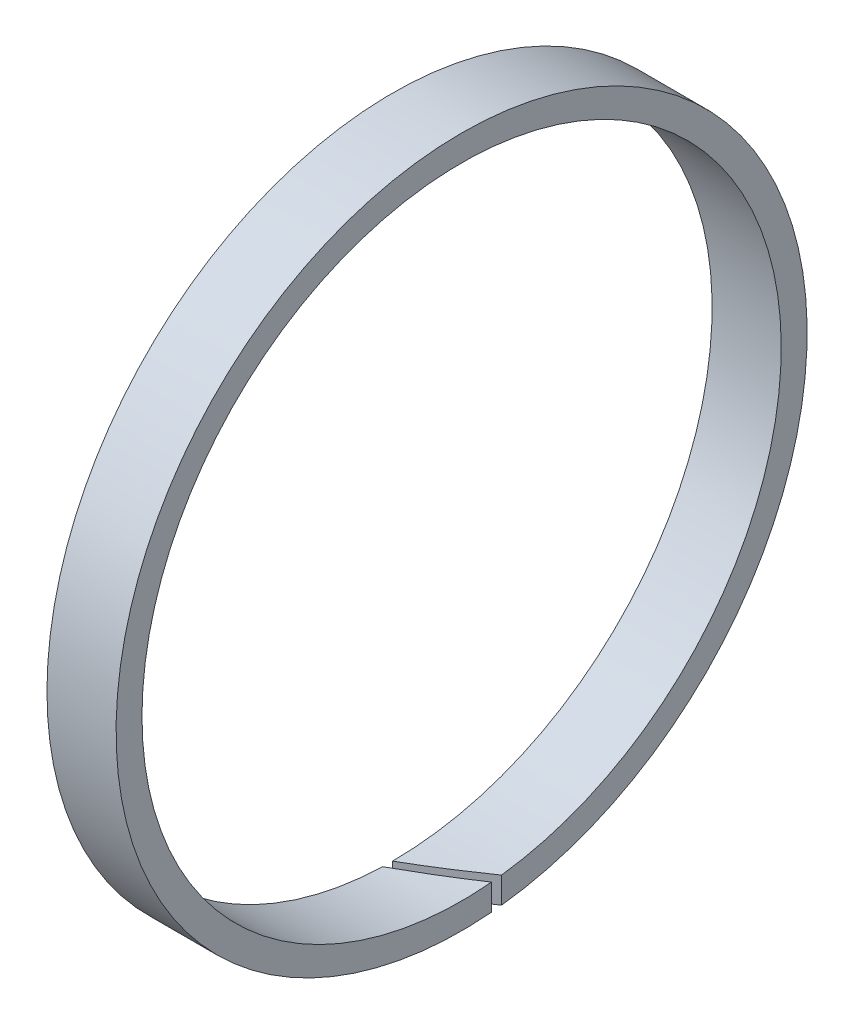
ISO-10303-21;
HEADER;
FILE_DESCRIPTION(('STEP AP214'),'2;1');
FILE_NAME('part.step','',(''),(''),'','','');
FILE_SCHEMA(('AUTOMOTIVE_DESIGN { 1 0 10303 214 1 1 1 1 }'));
ENDSEC;
DATA;
#1=APPLICATION_CONTEXT('core data for automotive mechanical design processes');
#2=APPLICATION_PROTOCOL_DEFINITION('international standard','automotive_design',2000,#1);
#3=PRODUCT_CONTEXT('',#1,'mechanical');
#4=PRODUCT('Part','Part','',(#3));
#5=PRODUCT_RELATED_PRODUCT_CATEGORY('part','',(#4));
#6=PRODUCT_DEFINITION_FORMATION('','',#4);
#7=PRODUCT_DEFINITION_CONTEXT('part definition',#1,'design');
#8=PRODUCT_DEFINITION('design','',#6,#7);
#9=PRODUCT_DEFINITION_SHAPE('','',#8);
#10=(LENGTH_UNIT() NAMED_UNIT(*) SI_UNIT(.MILLI.,.METRE.));
#11=(NAMED_UNIT(*) PLANE_ANGLE_UNIT() SI_UNIT($,.RADIAN.));
#12=(NAMED_UNIT(*) SI_UNIT($,.STERADIAN.) SOLID_ANGLE_UNIT());
#13=UNCERTAINTY_MEASURE_WITH_UNIT(LENGTH_MEASURE(1.E-05),#10,'distance_accuracy_value','');
#14=(GEOMETRIC_REPRESENTATION_CONTEXT(3) GLOBAL_UNCERTAINTY_ASSIGNED_CONTEXT((#13)) GLOBAL_UNIT_ASSIGNED_CONTEXT((#10,
#11,#12)) REPRESENTATION_CONTEXT('',''));
#15=CARTESIAN_POINT('',(0.,0.,0.));
#16=DIRECTION('',(0.,0.,1.));
#17=DIRECTION('',(1.,0.,0.));
#18=AXIS2_PLACEMENT_3D('',#15,#16,#17);
#19=CARTESIAN_POINT('',(0.,20.,0.));
#20=DIRECTION('',(1.,0.,0.));
#21=DIRECTION('',(0.,0.,-1.));
#22=AXIS2_PLACEMENT_3D('',#19,#20,#21);
#23=PLANE('',#22);
#24=CARTESIAN_POINT('',(0.,0.,0.));
#25=DIRECTION('',(-1.,0.,0.));
#26=DIRECTION('',(0.,0.,1.));
#27=AXIS2_PLACEMENT_3D('',#24,#25,#26);
#28=CIRCLE('',#27,20.);
#29=CARTESIAN_POINT('',(0.,-19.9916649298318,0.577350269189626));
#30=VERTEX_POINT('',#29);
#31=CARTESIAN_POINT('',(0.,-20.,0.));
#32=VERTEX_POINT('',#31);
#33=EDGE_CURVE('E78',#30,#32,#28,.T.);
#34=ORIENTED_EDGE('',*,*,#33,.T.);
#35=DIRECTION('',(0.,1.,0.));
#36=VECTOR('',#35,1.);
#37=CARTESIAN_POINT('',(0.,-20.,0.));
#38=LINE('',#37,#36);
#39=CARTESIAN_POINT('',(0.,-18.5,0.));
#40=VERTEX_POINT('',#39);
#41=EDGE_CURVE('E52',#32,#40,#38,.T.);
#42=ORIENTED_EDGE('',*,*,#41,.T.);
#43=CARTESIAN_POINT('',(0.,0.,0.));
#44=DIRECTION('',(-1.,0.,0.));
#45=DIRECTION('',(0.,0.,1.));
#46=AXIS2_PLACEMENT_3D('',#43,#44,#45);
#47=CIRCLE('',#46,18.5);
#48=CARTESIAN_POINT('',(0.,-18.490988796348,0.577350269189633));
#49=VERTEX_POINT('',#48);
#50=EDGE_CURVE('E74',#49,#40,#47,.T.);
#51=ORIENTED_EDGE('',*,*,#50,.F.);
#52=DIRECTION('',(0.,1.,0.));
#53=VECTOR('',#52,1.);
#54=CARTESIAN_POINT('',(0.,-20.,0.577350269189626));
#55=LINE('',#54,#53);
#56=EDGE_CURVE('E68',#30,#49,#55,.T.);
#57=ORIENTED_EDGE('',*,*,#56,.F.);
#58=EDGE_LOOP('',(#34,#42,#51,#57));
#59=FACE_BOUND('',#58,.T.);
#60=ADVANCED_FACE('F30',(#59),#23,.F.);
#61=CARTESIAN_POINT('',(0.,0.,0.));
#62=DIRECTION('',(-1.,0.,0.));
#63=DIRECTION('',(0.,0.,1.));
#64=AXIS2_PLACEMENT_3D('',#61,#62,#63);
#65=CYLINDRICAL_SURFACE('',#64,18.5);
#66=ORIENTED_EDGE('',*,*,#50,.T.);
#67=CARTESIAN_POINT('',(0.,0.,0.));
#68=DIRECTION('',(-0.500000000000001,0.,-0.866025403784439));
#69=DIRECTION('',(-0.866025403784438,0.,0.500000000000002));
#70=AXIS2_PLACEMENT_3D('',#67,#68,#69);
#71=ELLIPSE('',#70,36.9999999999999,18.5);
#72=CARTESIAN_POINT('',(4.,-18.3552898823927,-2.30940107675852));
#73=VERTEX_POINT('',#72);
#74=EDGE_CURVE('E83',#40,#73,#71,.F.);
#75=ORIENTED_EDGE('',*,*,#74,.T.);
#76=CARTESIAN_POINT('',(4.,0.,0.));
#77=DIRECTION('',(-1.,0.,0.));
#78=DIRECTION('',(0.,0.,1.));
#79=AXIS2_PLACEMENT_3D('',#76,#77,#78);
#80=CIRCLE('',#79,18.5);
#81=CARTESIAN_POINT('',(4.,-18.4187404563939,-1.73205080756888));
#82=VERTEX_POINT('',#81);
#83=EDGE_CURVE('E85',#82,#73,#80,.T.);
#84=ORIENTED_EDGE('',*,*,#83,.F.);
#85=CARTESIAN_POINT('',(1.,0.,0.));
#86=DIRECTION('',(0.500000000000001,0.,0.866025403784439));
#87=DIRECTION('',(-0.866025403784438,0.,0.500000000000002));
#88=AXIS2_PLACEMENT_3D('',#85,#86,#87);
#89=ELLIPSE('',#88,36.9999999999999,18.5);
#90=EDGE_CURVE('E88',#82,#49,#89,.F.);
#91=ORIENTED_EDGE('',*,*,#90,.T.);
#92=EDGE_LOOP('',(#66,#75,#84,#91));
#93=FACE_BOUND('',#92,.T.);
#94=ADVANCED_FACE('F95',(#93),#65,.F.);
#95=CARTESIAN_POINT('',(4.,18.5,0.));
#96=DIRECTION('',(-1.,0.,0.));
#97=DIRECTION('',(0.,0.,1.));
#98=AXIS2_PLACEMENT_3D('',#95,#96,#97);
#99=PLANE('',#98);
#100=ORIENTED_EDGE('',*,*,#83,.T.);
#101=DIRECTION('',(0.,1.,0.));
#102=VECTOR('',#101,1.);
#103=CARTESIAN_POINT('',(4.,-20.,-2.30940107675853));
#104=LINE('',#103,#102);
#105=CARTESIAN_POINT('',(4.,-19.8662192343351,-2.30940107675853));
#106=VERTEX_POINT('',#105);
#107=EDGE_CURVE('E97',#106,#73,#104,.T.);
#108=ORIENTED_EDGE('',*,*,#107,.F.);
#109=CARTESIAN_POINT('',(4.,0.,0.));
#110=DIRECTION('',(-1.,0.,0.));
#111=DIRECTION('',(0.,0.,1.));
#112=AXIS2_PLACEMENT_3D('',#109,#110,#111);
#113=CIRCLE('',#112,20.);
#114=CARTESIAN_POINT('',(4.,-19.9248588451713,-1.73205080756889));
#115=VERTEX_POINT('',#114);
#116=EDGE_CURVE('E82',#115,#106,#113,.T.);
#117=ORIENTED_EDGE('',*,*,#116,.F.);
#118=DIRECTION('',(0.,1.,0.));
#119=VECTOR('',#118,1.);
#120=CARTESIAN_POINT('',(4.,-20.,-1.73205080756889));
#121=LINE('',#120,#119);
#122=EDGE_CURVE('E44',#115,#82,#121,.T.);
#123=ORIENTED_EDGE('',*,*,#122,.T.);
#124=EDGE_LOOP('',(#100,#108,#117,#123));
#125=FACE_BOUND('',#124,.T.);
#126=ADVANCED_FACE('F104',(#125),#99,.F.);
#127=CARTESIAN_POINT('',(0.,0.,0.));
#128=DIRECTION('',(-1.,0.,0.));
#129=DIRECTION('',(0.,0.,1.));
#130=AXIS2_PLACEMENT_3D('',#127,#128,#129);
#131=CYLINDRICAL_SURFACE('',#130,20.);
#132=ORIENTED_EDGE('',*,*,#33,.F.);
#133=CARTESIAN_POINT('',(1.,0.,0.));
#134=DIRECTION('',(0.500000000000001,0.,0.866025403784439));
#135=DIRECTION('',(-0.866025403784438,0.,0.500000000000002));
#136=AXIS2_PLACEMENT_3D('',#133,#134,#135);
#137=ELLIPSE('',#136,39.9999999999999,20.);
#138=EDGE_CURVE('E37',#30,#115,#137,.T.);
#139=ORIENTED_EDGE('',*,*,#138,.T.);
#140=ORIENTED_EDGE('',*,*,#116,.T.);
#141=CARTESIAN_POINT('',(0.,0.,0.));
#142=DIRECTION('',(-0.500000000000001,0.,-0.866025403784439));
#143=DIRECTION('',(-0.866025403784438,0.,0.500000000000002));
#144=AXIS2_PLACEMENT_3D('',#141,#142,#143);
#145=ELLIPSE('',#144,39.9999999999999,20.);
#146=EDGE_CURVE('E11',#106,#32,#145,.T.);
#147=ORIENTED_EDGE('',*,*,#146,.T.);
#148=EDGE_LOOP('',(#132,#139,#140,#147));
#149=FACE_BOUND('',#148,.T.);
#150=ADVANCED_FACE('F81',(#149),#131,.T.);
#151=CARTESIAN_POINT('',(4.,-20.,-1.73205080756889));
#152=DIRECTION('',(0.500000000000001,0.,0.866025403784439));
#153=DIRECTION('',(0.866025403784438,0.,-0.500000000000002));
#154=AXIS2_PLACEMENT_3D('',#151,#152,#153);
#155=PLANE('',#154);
#156=ORIENTED_EDGE('',*,*,#122,.F.);
#157=ORIENTED_EDGE('',*,*,#138,.F.);
#158=ORIENTED_EDGE('',*,*,#56,.T.);
#159=ORIENTED_EDGE('',*,*,#90,.F.);
#160=EDGE_LOOP('',(#156,#157,#158,#159));
#161=FACE_BOUND('',#160,.T.);
#162=ADVANCED_FACE('F67',(#161),#155,.F.);
#163=CARTESIAN_POINT('',(0.,-20.,0.));
#164=DIRECTION('',(-0.500000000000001,0.,-0.866025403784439));
#165=DIRECTION('',(-0.866025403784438,0.,0.500000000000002));
#166=AXIS2_PLACEMENT_3D('',#163,#164,#165);
#167=PLANE('',#166);
#168=ORIENTED_EDGE('',*,*,#41,.F.);
#169=ORIENTED_EDGE('',*,*,#146,.F.);
#170=ORIENTED_EDGE('',*,*,#107,.T.);
#171=ORIENTED_EDGE('',*,*,#74,.F.);
#172=EDGE_LOOP('',(#168,#169,#170,#171));
#173=FACE_BOUND('',#172,.T.);
#174=ADVANCED_FACE('F102',(#173),#167,.F.);
#175=CLOSED_SHELL('',(#60,#94,#126,#150,#162,#174));
#176=MANIFOLD_SOLID_BREP('B2',#175);
#177=ADVANCED_BREP_SHAPE_REPRESENTATION('',(#18,#176),#14);
#178=SHAPE_DEFINITION_REPRESENTATION(#9,#177);
ENDSEC;
END-ISO-10303-21;
